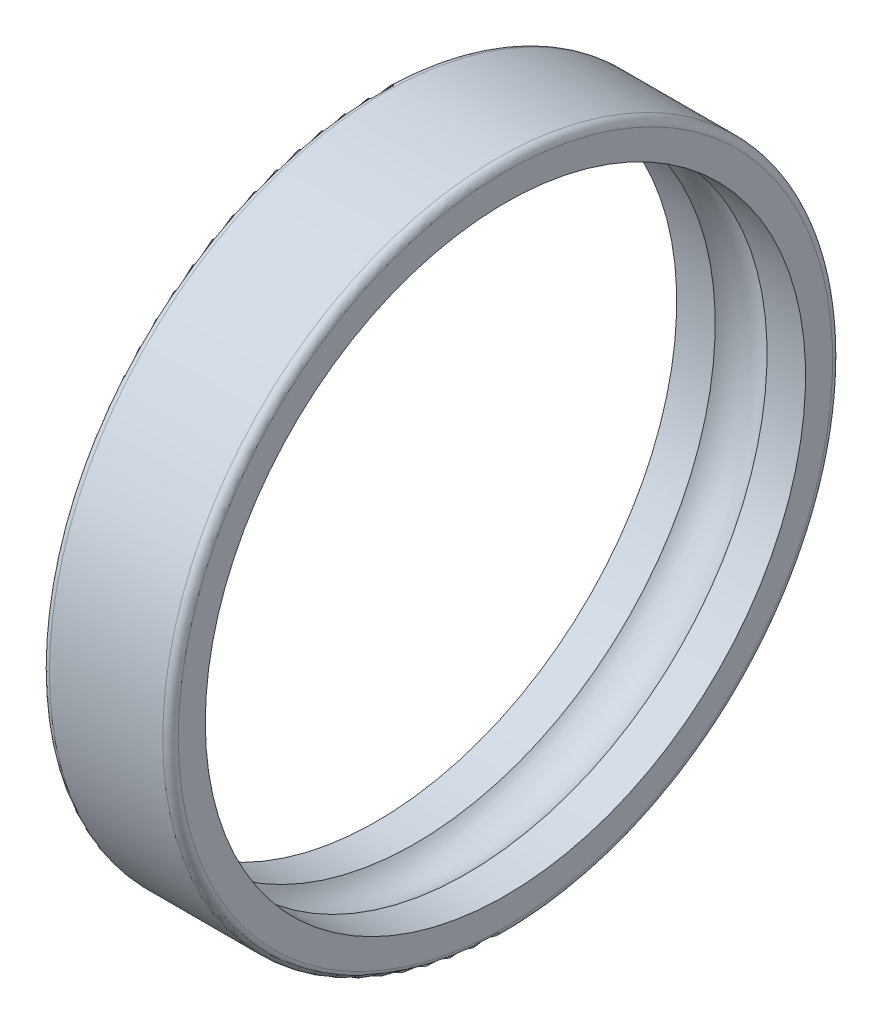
ISO-10303-21;
HEADER;
FILE_DESCRIPTION(('STEP AP214'),'2;1');
FILE_NAME('part.step','',(''),(''),'','','');
FILE_SCHEMA(('AUTOMOTIVE_DESIGN { 1 0 10303 214 1 1 1 1 }'));
ENDSEC;
DATA;
#1=APPLICATION_CONTEXT('core data for automotive mechanical design processes');
#2=APPLICATION_PROTOCOL_DEFINITION('international standard','automotive_design',2000,#1);
#3=PRODUCT_CONTEXT('',#1,'mechanical');
#4=PRODUCT('Part','Part','',(#3));
#5=PRODUCT_RELATED_PRODUCT_CATEGORY('part','',(#4));
#6=PRODUCT_DEFINITION_FORMATION('','',#4);
#7=PRODUCT_DEFINITION_CONTEXT('part definition',#1,'design');
#8=PRODUCT_DEFINITION('design','',#6,#7);
#9=PRODUCT_DEFINITION_SHAPE('','',#8);
#10=(LENGTH_UNIT() NAMED_UNIT(*) SI_UNIT(.MILLI.,.METRE.));
#11=(NAMED_UNIT(*) PLANE_ANGLE_UNIT() SI_UNIT($,.RADIAN.));
#12=(NAMED_UNIT(*) SI_UNIT($,.STERADIAN.) SOLID_ANGLE_UNIT());
#13=UNCERTAINTY_MEASURE_WITH_UNIT(LENGTH_MEASURE(1.E-05),#10,'distance_accuracy_value','');
#14=(GEOMETRIC_REPRESENTATION_CONTEXT(3) GLOBAL_UNCERTAINTY_ASSIGNED_CONTEXT((#13)) GLOBAL_UNIT_ASSIGNED_CONTEXT((#10,
#11,#12)) REPRESENTATION_CONTEXT('',''));
#15=CARTESIAN_POINT('',(0.,0.,0.));
#16=DIRECTION('',(0.,0.,1.));
#17=DIRECTION('',(1.,0.,0.));
#18=AXIS2_PLACEMENT_3D('',#15,#16,#17);
#19=CARTESIAN_POINT('',(0.300000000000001,0.,0.));
#20=DIRECTION('',(-1.,0.,0.));
#21=DIRECTION('',(0.,0.,1.));
#22=AXIS2_PLACEMENT_3D('',#19,#20,#21);
#23=TOROIDAL_SURFACE('',#22,12.7,0.3);
#24=CARTESIAN_POINT('',(0.,0.,0.));
#25=DIRECTION('',(-1.,0.,0.));
#26=DIRECTION('',(0.,0.,1.));
#27=AXIS2_PLACEMENT_3D('',#24,#25,#26);
#28=CIRCLE('',#27,12.7);
#29=CARTESIAN_POINT('',(0.,0.,12.7));
#30=VERTEX_POINT('',#29);
#31=EDGE_CURVE('E10',#30,#30,#28,.T.);
#32=ORIENTED_EDGE('',*,*,#31,.F.);
#33=EDGE_LOOP('',(#32));
#34=FACE_BOUND('',#33,.T.);
#35=CARTESIAN_POINT('',(0.300000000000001,0.,0.));
#36=DIRECTION('',(-1.,0.,0.));
#37=DIRECTION('',(0.,0.,1.));
#38=AXIS2_PLACEMENT_3D('',#35,#36,#37);
#39=CIRCLE('',#38,13.);
#40=CARTESIAN_POINT('',(0.300000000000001,0.,13.));
#41=VERTEX_POINT('',#40);
#42=EDGE_CURVE('E59',#41,#41,#39,.T.);
#43=ORIENTED_EDGE('',*,*,#42,.T.);
#44=EDGE_LOOP('',(#43));
#45=FACE_BOUND('',#44,.T.);
#46=ADVANCED_FACE('F31',(#34,#45),#23,.T.);
#47=CARTESIAN_POINT('',(0.,0.,-12.7));
#48=DIRECTION('',(1.,0.,0.));
#49=DIRECTION('',(0.,0.,-1.));
#50=AXIS2_PLACEMENT_3D('',#47,#48,#49);
#51=PLANE('',#50);
#52=CARTESIAN_POINT('',(0.,0.,0.));
#53=DIRECTION('',(-1.,0.,0.));
#54=DIRECTION('',(0.,0.,1.));
#55=AXIS2_PLACEMENT_3D('',#52,#53,#54);
#56=CIRCLE('',#55,11.65);
#57=CARTESIAN_POINT('',(0.,0.,11.65));
#58=VERTEX_POINT('',#57);
#59=EDGE_CURVE('E37',#58,#58,#56,.T.);
#60=ORIENTED_EDGE('',*,*,#59,.F.);
#61=EDGE_LOOP('',(#60));
#62=FACE_BOUND('',#61,.T.);
#63=ORIENTED_EDGE('',*,*,#31,.T.);
#64=EDGE_LOOP('',(#63));
#65=FACE_BOUND('',#64,.T.);
#66=ADVANCED_FACE('F96',(#62,#65),#51,.F.);
#67=CARTESIAN_POINT('',(0.,0.,0.));
#68=DIRECTION('',(-1.,0.,0.));
#69=DIRECTION('',(0.,0.,1.));
#70=AXIS2_PLACEMENT_3D('',#67,#68,#69);
#71=CYLINDRICAL_SURFACE('',#70,11.65);
#72=CARTESIAN_POINT('',(1.49376941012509,0.,0.));
#73=DIRECTION('',(-1.,0.,0.));
#74=DIRECTION('',(0.,0.,1.));
#75=AXIS2_PLACEMENT_3D('',#72,#73,#74);
#76=CIRCLE('',#75,11.65);
#77=CARTESIAN_POINT('',(1.49376941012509,0.,11.65));
#78=VERTEX_POINT('',#77);
#79=EDGE_CURVE('E41',#78,#78,#76,.T.);
#80=ORIENTED_EDGE('',*,*,#79,.F.);
#81=EDGE_LOOP('',(#80));
#82=FACE_BOUND('',#81,.T.);
#83=ORIENTED_EDGE('',*,*,#59,.T.);
#84=EDGE_LOOP('',(#83));
#85=FACE_BOUND('',#84,.T.);
#86=ADVANCED_FACE('F91',(#82,#85),#71,.F.);
#87=CARTESIAN_POINT('',(2.5,0.,0.));
#88=DIRECTION('',(-1.,0.,0.));
#89=DIRECTION('',(0.,0.,1.));
#90=AXIS2_PLACEMENT_3D('',#87,#88,#89);
#91=TOROIDAL_SURFACE('',#90,10.75,1.35);
#92=CARTESIAN_POINT('',(3.50623058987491,0.,0.));
#93=DIRECTION('',(-1.,0.,0.));
#94=DIRECTION('',(0.,0.,1.));
#95=AXIS2_PLACEMENT_3D('',#92,#93,#94);
#96=CIRCLE('',#95,11.65);
#97=CARTESIAN_POINT('',(3.50623058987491,0.,11.65));
#98=VERTEX_POINT('',#97);
#99=EDGE_CURVE('E45',#98,#98,#96,.T.);
#100=ORIENTED_EDGE('',*,*,#99,.F.);
#101=EDGE_LOOP('',(#100));
#102=FACE_BOUND('',#101,.T.);
#103=ORIENTED_EDGE('',*,*,#79,.T.);
#104=EDGE_LOOP('',(#103));
#105=FACE_BOUND('',#104,.T.);
#106=ADVANCED_FACE('F85',(#102,#105),#91,.F.);
#107=CARTESIAN_POINT('',(0.,0.,0.));
#108=DIRECTION('',(-1.,0.,0.));
#109=DIRECTION('',(0.,0.,1.));
#110=AXIS2_PLACEMENT_3D('',#107,#108,#109);
#111=CYLINDRICAL_SURFACE('',#110,11.65);
#112=CARTESIAN_POINT('',(5.,0.,0.));
#113=DIRECTION('',(-1.,0.,0.));
#114=DIRECTION('',(0.,0.,1.));
#115=AXIS2_PLACEMENT_3D('',#112,#113,#114);
#116=CIRCLE('',#115,11.65);
#117=CARTESIAN_POINT('',(5.,0.,11.65));
#118=VERTEX_POINT('',#117);
#119=EDGE_CURVE('E50',#118,#118,#116,.T.);
#120=ORIENTED_EDGE('',*,*,#119,.F.);
#121=EDGE_LOOP('',(#120));
#122=FACE_BOUND('',#121,.T.);
#123=ORIENTED_EDGE('',*,*,#99,.T.);
#124=EDGE_LOOP('',(#123));
#125=FACE_BOUND('',#124,.T.);
#126=ADVANCED_FACE('F79',(#122,#125),#111,.F.);
#127=CARTESIAN_POINT('',(5.,0.,-12.7));
#128=DIRECTION('',(-1.,0.,0.));
#129=DIRECTION('',(0.,0.,1.));
#130=AXIS2_PLACEMENT_3D('',#127,#128,#129);
#131=PLANE('',#130);
#132=CARTESIAN_POINT('',(5.,0.,0.));
#133=DIRECTION('',(-1.,0.,0.));
#134=DIRECTION('',(0.,0.,1.));
#135=AXIS2_PLACEMENT_3D('',#132,#133,#134);
#136=CIRCLE('',#135,12.7);
#137=CARTESIAN_POINT('',(5.,0.,12.7));
#138=VERTEX_POINT('',#137);
#139=EDGE_CURVE('E53',#138,#138,#136,.T.);
#140=ORIENTED_EDGE('',*,*,#139,.F.);
#141=EDGE_LOOP('',(#140));
#142=FACE_BOUND('',#141,.T.);
#143=ORIENTED_EDGE('',*,*,#119,.T.);
#144=EDGE_LOOP('',(#143));
#145=FACE_BOUND('',#144,.T.);
#146=ADVANCED_FACE('F73',(#142,#145),#131,.F.);
#147=CARTESIAN_POINT('',(4.7,0.,0.));
#148=DIRECTION('',(-1.,0.,0.));
#149=DIRECTION('',(0.,0.,1.));
#150=AXIS2_PLACEMENT_3D('',#147,#148,#149);
#151=TOROIDAL_SURFACE('',#150,12.7,0.3);
#152=CARTESIAN_POINT('',(4.7,0.,0.));
#153=DIRECTION('',(-1.,0.,0.));
#154=DIRECTION('',(0.,0.,1.));
#155=AXIS2_PLACEMENT_3D('',#152,#153,#154);
#156=CIRCLE('',#155,13.);
#157=CARTESIAN_POINT('',(4.7,0.,13.));
#158=VERTEX_POINT('',#157);
#159=EDGE_CURVE('E56',#158,#158,#156,.T.);
#160=ORIENTED_EDGE('',*,*,#159,.F.);
#161=EDGE_LOOP('',(#160));
#162=FACE_BOUND('',#161,.T.);
#163=ORIENTED_EDGE('',*,*,#139,.T.);
#164=EDGE_LOOP('',(#163));
#165=FACE_BOUND('',#164,.T.);
#166=ADVANCED_FACE('F67',(#162,#165),#151,.T.);
#167=CARTESIAN_POINT('',(0.,0.,0.));
#168=DIRECTION('',(-1.,0.,0.));
#169=DIRECTION('',(0.,0.,1.));
#170=AXIS2_PLACEMENT_3D('',#167,#168,#169);
#171=CYLINDRICAL_SURFACE('',#170,13.);
#172=ORIENTED_EDGE('',*,*,#42,.F.);
#173=EDGE_LOOP('',(#172));
#174=FACE_BOUND('',#173,.T.);
#175=ORIENTED_EDGE('',*,*,#159,.T.);
#176=EDGE_LOOP('',(#175));
#177=FACE_BOUND('',#176,.T.);
#178=ADVANCED_FACE('F64',(#174,#177),#171,.T.);
#179=CLOSED_SHELL('',(#46,#66,#86,#106,#126,#146,#166,#178));
#180=MANIFOLD_SOLID_BREP('B2',#179);
#181=ADVANCED_BREP_SHAPE_REPRESENTATION('',(#18,#180),#14);
#182=SHAPE_DEFINITION_REPRESENTATION(#9,#181);
ENDSEC;
END-ISO-10303-21;
